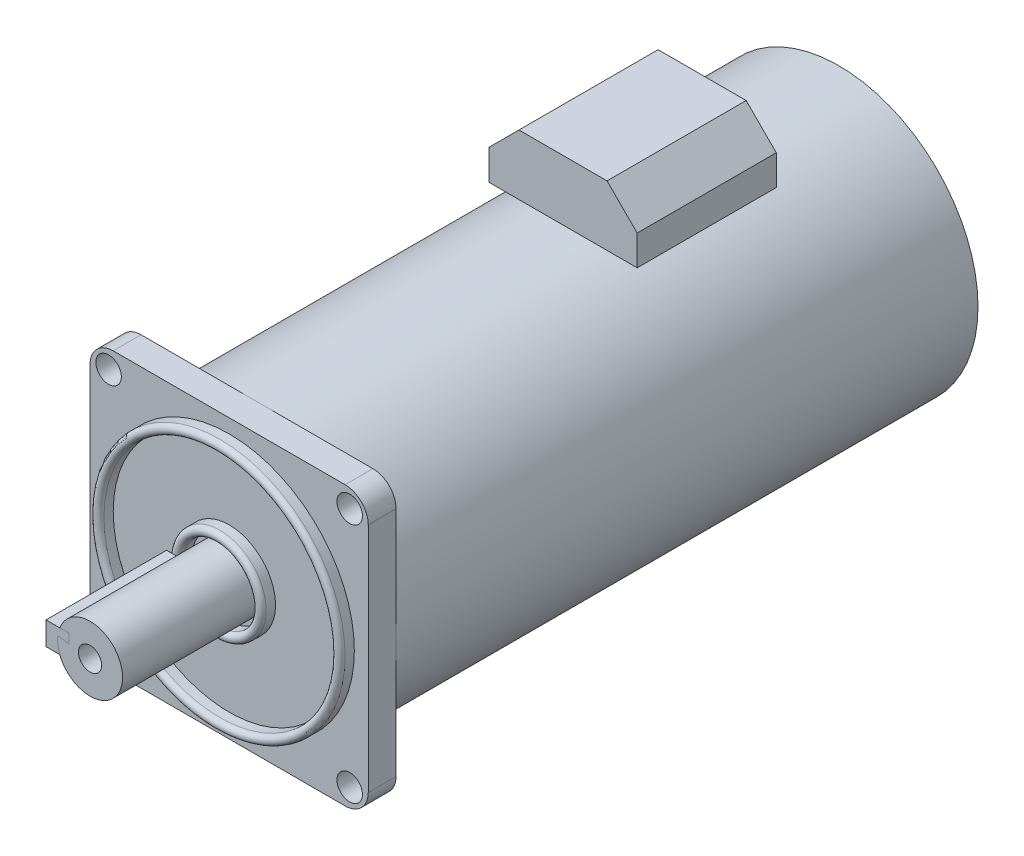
ISO-10303-21;
HEADER;
FILE_DESCRIPTION(('STEP AP214'),'2;1');
FILE_NAME('part.step','',(''),(''),'','','');
FILE_SCHEMA(('AUTOMOTIVE_DESIGN { 1 0 10303 214 1 1 1 1 }'));
ENDSEC;
DATA;
#1=APPLICATION_CONTEXT('core data for automotive mechanical design processes');
#2=APPLICATION_PROTOCOL_DEFINITION('international standard','automotive_design',2000,#1);
#3=PRODUCT_CONTEXT('',#1,'mechanical');
#4=PRODUCT('Part','Part','',(#3));
#5=PRODUCT_RELATED_PRODUCT_CATEGORY('part','',(#4));
#6=PRODUCT_DEFINITION_FORMATION('','',#4);
#7=PRODUCT_DEFINITION_CONTEXT('part definition',#1,'design');
#8=PRODUCT_DEFINITION('design','',#6,#7);
#9=PRODUCT_DEFINITION_SHAPE('','',#8);
#10=(LENGTH_UNIT() NAMED_UNIT(*) SI_UNIT(.MILLI.,.METRE.));
#11=(NAMED_UNIT(*) PLANE_ANGLE_UNIT() SI_UNIT($,.RADIAN.));
#12=(NAMED_UNIT(*) SI_UNIT($,.STERADIAN.) SOLID_ANGLE_UNIT());
#13=UNCERTAINTY_MEASURE_WITH_UNIT(LENGTH_MEASURE(1.E-05),#10,'distance_accuracy_value','');
#14=(GEOMETRIC_REPRESENTATION_CONTEXT(3) GLOBAL_UNCERTAINTY_ASSIGNED_CONTEXT((#13)) GLOBAL_UNIT_ASSIGNED_CONTEXT((#10,
#11,#12)) REPRESENTATION_CONTEXT('',''));
#15=CARTESIAN_POINT('',(0.,0.,0.));
#16=DIRECTION('',(0.,0.,1.));
#17=DIRECTION('',(1.,0.,0.));
#18=AXIS2_PLACEMENT_3D('',#15,#16,#17);
#19=CARTESIAN_POINT('',(16.,43.,29.5));
#20=DIRECTION('',(-1.,0.,0.));
#21=DIRECTION('',(0.,0.,1.));
#22=AXIS2_PLACEMENT_3D('',#19,#20,#21);
#23=PLANE('',#22);
#24=DIRECTION('',(0.,-1.,0.));
#25=VECTOR('',#24,1.);
#26=CARTESIAN_POINT('',(16.,43.,29.5));
#27=LINE('',#26,#25);
#28=CARTESIAN_POINT('',(16.,36.5,29.5));
#29=VERTEX_POINT('',#28);
#30=CARTESIAN_POINT('',(16.,30.,29.5));
#31=VERTEX_POINT('',#30);
#32=EDGE_CURVE('E108',#29,#31,#27,.T.);
#33=ORIENTED_EDGE('',*,*,#32,.F.);
#34=DIRECTION('',(0.,0.,1.));
#35=VECTOR('',#34,1.);
#36=CARTESIAN_POINT('',(16.,36.5,59.5));
#37=LINE('',#36,#35);
#38=CARTESIAN_POINT('',(16.,36.5,59.5));
#39=VERTEX_POINT('',#38);
#40=EDGE_CURVE('E13',#29,#39,#37,.T.);
#41=ORIENTED_EDGE('',*,*,#40,.T.);
#42=DIRECTION('',(0.,-1.,0.));
#43=VECTOR('',#42,1.);
#44=CARTESIAN_POINT('',(16.,43.,59.5));
#45=LINE('',#44,#43);
#46=CARTESIAN_POINT('',(16.,30.,59.5));
#47=VERTEX_POINT('',#46);
#48=EDGE_CURVE('E128',#39,#47,#45,.T.);
#49=ORIENTED_EDGE('',*,*,#48,.T.);
#50=DIRECTION('',(0.,0.,-1.));
#51=VECTOR('',#50,1.);
#52=CARTESIAN_POINT('',(16.,30.,29.5));
#53=LINE('',#52,#51);
#54=EDGE_CURVE('E123',#47,#31,#53,.T.);
#55=ORIENTED_EDGE('',*,*,#54,.T.);
#56=EDGE_LOOP('',(#33,#41,#49,#55));
#57=FACE_BOUND('',#56,.T.);
#58=ADVANCED_FACE('F57',(#57),#23,.F.);
#59=CARTESIAN_POINT('',(-16.,43.,29.5));
#60=DIRECTION('',(0.,0.,1.));
#61=DIRECTION('',(1.,0.,0.));
#62=AXIS2_PLACEMENT_3D('',#59,#60,#61);
#63=PLANE('',#62);
#64=DIRECTION('',(0.,-1.,0.));
#65=VECTOR('',#64,1.);
#66=CARTESIAN_POINT('',(-16.,43.,29.5));
#67=LINE('',#66,#65);
#68=CARTESIAN_POINT('',(-16.,36.5,29.5));
#69=VERTEX_POINT('',#68);
#70=CARTESIAN_POINT('',(-16.,30.,29.5));
#71=VERTEX_POINT('',#70);
#72=EDGE_CURVE('E117',#69,#71,#67,.T.);
#73=ORIENTED_EDGE('',*,*,#72,.F.);
#74=DIRECTION('',(0.707106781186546,0.707106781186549,0.));
#75=VECTOR('',#74,1.);
#76=CARTESIAN_POINT('',(-9.50000000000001,43.,29.5));
#77=LINE('',#76,#75);
#78=CARTESIAN_POINT('',(-9.50000000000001,43.,29.5));
#79=VERTEX_POINT('',#78);
#80=EDGE_CURVE('E65',#69,#79,#77,.T.);
#81=ORIENTED_EDGE('',*,*,#80,.T.);
#82=DIRECTION('',(-1.,0.,0.));
#83=VECTOR('',#82,1.);
#84=CARTESIAN_POINT('',(-16.,43.,29.5));
#85=LINE('',#84,#83);
#86=CARTESIAN_POINT('',(9.49999999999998,43.,29.5));
#87=VERTEX_POINT('',#86);
#88=EDGE_CURVE('E138',#87,#79,#85,.T.);
#89=ORIENTED_EDGE('',*,*,#88,.F.);
#90=DIRECTION('',(0.707106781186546,-0.707106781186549,0.));
#91=VECTOR('',#90,1.);
#92=CARTESIAN_POINT('',(9.49999999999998,43.,29.5));
#93=LINE('',#92,#91);
#94=EDGE_CURVE('E72',#87,#29,#93,.T.);
#95=ORIENTED_EDGE('',*,*,#94,.T.);
#96=ORIENTED_EDGE('',*,*,#32,.T.);
#97=DIRECTION('',(-1.,0.,0.));
#98=VECTOR('',#97,1.);
#99=CARTESIAN_POINT('',(-16.,30.,29.5));
#100=LINE('',#99,#98);
#101=EDGE_CURVE('E111',#31,#71,#100,.T.);
#102=ORIENTED_EDGE('',*,*,#101,.T.);
#103=EDGE_LOOP('',(#73,#81,#89,#95,#96,#102));
#104=FACE_BOUND('',#103,.T.);
#105=ADVANCED_FACE('F110',(#104),#63,.F.);
#106=CARTESIAN_POINT('',(-16.,43.,29.5));
#107=DIRECTION('',(1.,0.,0.));
#108=DIRECTION('',(0.,0.,-1.));
#109=AXIS2_PLACEMENT_3D('',#106,#107,#108);
#110=PLANE('',#109);
#111=DIRECTION('',(0.,-1.,0.));
#112=VECTOR('',#111,1.);
#113=CARTESIAN_POINT('',(-16.,43.,59.5));
#114=LINE('',#113,#112);
#115=CARTESIAN_POINT('',(-16.,36.5,59.5));
#116=VERTEX_POINT('',#115);
#117=CARTESIAN_POINT('',(-16.,30.,59.5));
#118=VERTEX_POINT('',#117);
#119=EDGE_CURVE('E140',#116,#118,#114,.T.);
#120=ORIENTED_EDGE('',*,*,#119,.F.);
#121=DIRECTION('',(0.,0.,-1.));
#122=VECTOR('',#121,1.);
#123=CARTESIAN_POINT('',(-16.,36.5,29.5));
#124=LINE('',#123,#122);
#125=EDGE_CURVE('E80',#116,#69,#124,.T.);
#126=ORIENTED_EDGE('',*,*,#125,.T.);
#127=ORIENTED_EDGE('',*,*,#72,.T.);
#128=DIRECTION('',(0.,0.,1.));
#129=VECTOR('',#128,1.);
#130=CARTESIAN_POINT('',(-16.,30.,29.5));
#131=LINE('',#130,#129);
#132=EDGE_CURVE('E125',#71,#118,#131,.T.);
#133=ORIENTED_EDGE('',*,*,#132,.T.);
#134=EDGE_LOOP('',(#120,#126,#127,#133));
#135=FACE_BOUND('',#134,.T.);
#136=ADVANCED_FACE('F165',(#135),#110,.F.);
#137=CARTESIAN_POINT('',(-16.,43.,59.5));
#138=DIRECTION('',(0.,0.,-1.));
#139=DIRECTION('',(-1.,0.,0.));
#140=AXIS2_PLACEMENT_3D('',#137,#138,#139);
#141=PLANE('',#140);
#142=DIRECTION('',(1.,0.,0.));
#143=VECTOR('',#142,1.);
#144=CARTESIAN_POINT('',(-16.,43.,59.5));
#145=LINE('',#144,#143);
#146=CARTESIAN_POINT('',(-9.50000000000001,43.,59.5));
#147=VERTEX_POINT('',#146);
#148=CARTESIAN_POINT('',(9.50000000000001,43.,59.5));
#149=VERTEX_POINT('',#148);
#150=EDGE_CURVE('E132',#147,#149,#145,.T.);
#151=ORIENTED_EDGE('',*,*,#150,.F.);
#152=DIRECTION('',(-0.707106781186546,-0.707106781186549,0.));
#153=VECTOR('',#152,1.);
#154=CARTESIAN_POINT('',(-9.50000000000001,43.,59.5));
#155=LINE('',#154,#153);
#156=EDGE_CURVE('E150',#147,#116,#155,.T.);
#157=ORIENTED_EDGE('',*,*,#156,.T.);
#158=ORIENTED_EDGE('',*,*,#119,.T.);
#159=DIRECTION('',(1.,0.,0.));
#160=VECTOR('',#159,1.);
#161=CARTESIAN_POINT('',(-16.,30.,59.5));
#162=LINE('',#161,#160);
#163=EDGE_CURVE('E136',#118,#47,#162,.T.);
#164=ORIENTED_EDGE('',*,*,#163,.T.);
#165=ORIENTED_EDGE('',*,*,#48,.F.);
#166=DIRECTION('',(-0.707106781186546,0.707106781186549,0.));
#167=VECTOR('',#166,1.);
#168=CARTESIAN_POINT('',(9.49999999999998,43.,59.5));
#169=LINE('',#168,#167);
#170=EDGE_CURVE('E148',#39,#149,#169,.T.);
#171=ORIENTED_EDGE('',*,*,#170,.T.);
#172=EDGE_LOOP('',(#151,#157,#158,#164,#165,#171));
#173=FACE_BOUND('',#172,.T.);
#174=ADVANCED_FACE('F164',(#173),#141,.F.);
#175=CARTESIAN_POINT('',(0.,43.,0.));
#176=DIRECTION('',(0.,1.,0.));
#177=DIRECTION('',(0.,0.,1.));
#178=AXIS2_PLACEMENT_3D('',#175,#176,#177);
#179=PLANE('',#178);
#180=ORIENTED_EDGE('',*,*,#88,.T.);
#181=DIRECTION('',(0.,0.,1.));
#182=VECTOR('',#181,1.);
#183=CARTESIAN_POINT('',(-9.50000000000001,43.,59.5));
#184=LINE('',#183,#182);
#185=EDGE_CURVE('E145',#79,#147,#184,.T.);
#186=ORIENTED_EDGE('',*,*,#185,.T.);
#187=ORIENTED_EDGE('',*,*,#150,.T.);
#188=DIRECTION('',(0.,0.,-1.));
#189=VECTOR('',#188,1.);
#190=CARTESIAN_POINT('',(9.49999999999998,43.,29.5));
#191=LINE('',#190,#189);
#192=EDGE_CURVE('E116',#149,#87,#191,.T.);
#193=ORIENTED_EDGE('',*,*,#192,.T.);
#194=EDGE_LOOP('',(#180,#186,#187,#193));
#195=FACE_BOUND('',#194,.T.);
#196=ADVANCED_FACE('F158',(#195),#179,.T.);
#197=CARTESIAN_POINT('',(0.,30.,0.));
#198=DIRECTION('',(0.,1.,0.));
#199=DIRECTION('',(0.,0.,1.));
#200=AXIS2_PLACEMENT_3D('',#197,#198,#199);
#201=PLANE('',#200);
#202=ORIENTED_EDGE('',*,*,#54,.F.);
#203=ORIENTED_EDGE('',*,*,#163,.F.);
#204=ORIENTED_EDGE('',*,*,#132,.F.);
#205=ORIENTED_EDGE('',*,*,#101,.F.);
#206=EDGE_LOOP('',(#202,#203,#204,#205));
#207=FACE_BOUND('',#206,.T.);
#208=ADVANCED_FACE('F121',(#207),#201,.F.);
#209=CARTESIAN_POINT('',(-9.50000000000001,43.,0.));
#210=DIRECTION('',(-0.707106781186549,0.707106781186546,0.));
#211=DIRECTION('',(0.,0.,-1.));
#212=AXIS2_PLACEMENT_3D('',#209,#210,#211);
#213=PLANE('',#212);
#214=ORIENTED_EDGE('',*,*,#80,.F.);
#215=ORIENTED_EDGE('',*,*,#125,.F.);
#216=ORIENTED_EDGE('',*,*,#156,.F.);
#217=ORIENTED_EDGE('',*,*,#185,.F.);
#218=EDGE_LOOP('',(#214,#215,#216,#217));
#219=FACE_BOUND('',#218,.T.);
#220=ADVANCED_FACE('F162',(#219),#213,.T.);
#221=CARTESIAN_POINT('',(9.49999999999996,43.,0.));
#222=DIRECTION('',(0.707106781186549,0.707106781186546,0.));
#223=DIRECTION('',(0.,0.,1.));
#224=AXIS2_PLACEMENT_3D('',#221,#222,#223);
#225=PLANE('',#224);
#226=ORIENTED_EDGE('',*,*,#170,.F.);
#227=ORIENTED_EDGE('',*,*,#40,.F.);
#228=ORIENTED_EDGE('',*,*,#94,.F.);
#229=ORIENTED_EDGE('',*,*,#192,.F.);
#230=EDGE_LOOP('',(#226,#227,#228,#229));
#231=FACE_BOUND('',#230,.T.);
#232=ADVANCED_FACE('F59',(#231),#225,.T.);
#233=CLOSED_SHELL('',(#58,#105,#136,#174,#196,#208,#220,#232));
#234=MANIFOLD_SOLID_BREP('B2',#233);
#235=CARTESIAN_POINT('',(-9.5,-2.5,135.5));
#236=DIRECTION('',(-1.,0.,0.));
#237=DIRECTION('',(0.,0.,1.));
#238=AXIS2_PLACEMENT_3D('',#235,#236,#237);
#239=PLANE('',#238);
#240=DIRECTION('',(0.,-1.,0.));
#241=VECTOR('',#240,1.);
#242=CARTESIAN_POINT('',(-9.5,-2.5,161.5));
#243=LINE('',#242,#241);
#244=CARTESIAN_POINT('',(-9.5,2.5,161.5));
#245=VERTEX_POINT('',#244);
#246=CARTESIAN_POINT('',(-9.5,-2.5,161.5));
#247=VERTEX_POINT('',#246);
#248=EDGE_CURVE('E305',#245,#247,#243,.T.);
#249=ORIENTED_EDGE('',*,*,#248,.F.);
#250=DIRECTION('',(0.,0.,1.));
#251=VECTOR('',#250,1.);
#252=CARTESIAN_POINT('',(-9.5,2.5,135.5));
#253=LINE('',#252,#251);
#254=CARTESIAN_POINT('',(-9.5,2.5,135.5));
#255=VERTEX_POINT('',#254);
#256=EDGE_CURVE('E55',#255,#245,#253,.T.);
#257=ORIENTED_EDGE('',*,*,#256,.F.);
#258=DIRECTION('',(0.,-1.,0.));
#259=VECTOR('',#258,1.);
#260=CARTESIAN_POINT('',(-9.5,-2.5,135.5));
#261=LINE('',#260,#259);
#262=CARTESIAN_POINT('',(-9.5,-2.5,135.5));
#263=VERTEX_POINT('',#262);
#264=EDGE_CURVE('E299',#255,#263,#261,.T.);
#265=ORIENTED_EDGE('',*,*,#264,.T.);
#266=DIRECTION('',(0.,0.,1.));
#267=VECTOR('',#266,1.);
#268=CARTESIAN_POINT('',(-9.5,-2.5,135.5));
#269=LINE('',#268,#267);
#270=EDGE_CURVE('E244',#263,#247,#269,.T.);
#271=ORIENTED_EDGE('',*,*,#270,.T.);
#272=EDGE_LOOP('',(#249,#257,#265,#271));
#273=FACE_BOUND('',#272,.T.);
#274=ADVANCED_FACE('F241',(#273),#239,.T.);
#275=CARTESIAN_POINT('',(-4.5,2.5,135.5));
#276=DIRECTION('',(0.,1.,0.));
#277=DIRECTION('',(0.,0.,1.));
#278=AXIS2_PLACEMENT_3D('',#275,#276,#277);
#279=PLANE('',#278);
#280=DIRECTION('',(-1.,0.,0.));
#281=VECTOR('',#280,1.);
#282=CARTESIAN_POINT('',(-4.5,2.5,161.5));
#283=LINE('',#282,#281);
#284=CARTESIAN_POINT('',(-4.5,2.5,161.5));
#285=VERTEX_POINT('',#284);
#286=EDGE_CURVE('E301',#285,#245,#283,.T.);
#287=ORIENTED_EDGE('',*,*,#286,.F.);
#288=DIRECTION('',(0.,0.,1.));
#289=VECTOR('',#288,1.);
#290=CARTESIAN_POINT('',(-4.5,2.5,135.5));
#291=LINE('',#290,#289);
#292=CARTESIAN_POINT('',(-4.5,2.5,135.5));
#293=VERTEX_POINT('',#292);
#294=EDGE_CURVE('E250',#293,#285,#291,.T.);
#295=ORIENTED_EDGE('',*,*,#294,.F.);
#296=DIRECTION('',(-1.,0.,0.));
#297=VECTOR('',#296,1.);
#298=CARTESIAN_POINT('',(-4.5,2.5,135.5));
#299=LINE('',#298,#297);
#300=EDGE_CURVE('E296',#293,#255,#299,.T.);
#301=ORIENTED_EDGE('',*,*,#300,.T.);
#302=ORIENTED_EDGE('',*,*,#256,.T.);
#303=EDGE_LOOP('',(#287,#295,#301,#302));
#304=FACE_BOUND('',#303,.T.);
#305=ADVANCED_FACE('F315',(#304),#279,.T.);
#306=CARTESIAN_POINT('',(-4.5,-2.5,135.5));
#307=DIRECTION('',(1.,0.,0.));
#308=DIRECTION('',(0.,0.,-1.));
#309=AXIS2_PLACEMENT_3D('',#306,#307,#308);
#310=PLANE('',#309);
#311=DIRECTION('',(0.,1.,0.));
#312=VECTOR('',#311,1.);
#313=CARTESIAN_POINT('',(-4.5,-2.5,161.5));
#314=LINE('',#313,#312);
#315=CARTESIAN_POINT('',(-4.5,-2.5,161.5));
#316=VERTEX_POINT('',#315);
#317=EDGE_CURVE('E291',#316,#285,#314,.T.);
#318=ORIENTED_EDGE('',*,*,#317,.F.);
#319=DIRECTION('',(0.,0.,1.));
#320=VECTOR('',#319,1.);
#321=CARTESIAN_POINT('',(-4.5,-2.5,135.5));
#322=LINE('',#321,#320);
#323=CARTESIAN_POINT('',(-4.5,-2.5,135.5));
#324=VERTEX_POINT('',#323);
#325=EDGE_CURVE('E286',#324,#316,#322,.T.);
#326=ORIENTED_EDGE('',*,*,#325,.F.);
#327=DIRECTION('',(0.,1.,0.));
#328=VECTOR('',#327,1.);
#329=CARTESIAN_POINT('',(-4.5,-2.5,135.5));
#330=LINE('',#329,#328);
#331=EDGE_CURVE('E289',#324,#293,#330,.T.);
#332=ORIENTED_EDGE('',*,*,#331,.T.);
#333=ORIENTED_EDGE('',*,*,#294,.T.);
#334=EDGE_LOOP('',(#318,#326,#332,#333));
#335=FACE_BOUND('',#334,.T.);
#336=ADVANCED_FACE('F288',(#335),#310,.T.);
#337=CARTESIAN_POINT('',(-4.5,-2.5,135.5));
#338=DIRECTION('',(0.,-1.,0.));
#339=DIRECTION('',(1.,0.,0.));
#340=AXIS2_PLACEMENT_3D('',#337,#338,#339);
#341=PLANE('',#340);
#342=DIRECTION('',(1.,0.,0.));
#343=VECTOR('',#342,1.);
#344=CARTESIAN_POINT('',(-4.5,-2.5,161.5));
#345=LINE('',#344,#343);
#346=EDGE_CURVE('E308',#247,#316,#345,.T.);
#347=ORIENTED_EDGE('',*,*,#346,.F.);
#348=ORIENTED_EDGE('',*,*,#270,.F.);
#349=DIRECTION('',(1.,0.,0.));
#350=VECTOR('',#349,1.);
#351=CARTESIAN_POINT('',(-4.5,-2.5,135.5));
#352=LINE('',#351,#350);
#353=EDGE_CURVE('E295',#263,#324,#352,.T.);
#354=ORIENTED_EDGE('',*,*,#353,.T.);
#355=ORIENTED_EDGE('',*,*,#325,.T.);
#356=EDGE_LOOP('',(#347,#348,#354,#355));
#357=FACE_BOUND('',#356,.T.);
#358=ADVANCED_FACE('F298',(#357),#341,.T.);
#359=CARTESIAN_POINT('',(0.,0.,135.5));
#360=DIRECTION('',(0.,0.,1.));
#361=DIRECTION('',(1.,0.,0.));
#362=AXIS2_PLACEMENT_3D('',#359,#360,#361);
#363=PLANE('',#362);
#364=ORIENTED_EDGE('',*,*,#264,.F.);
#365=ORIENTED_EDGE('',*,*,#300,.F.);
#366=ORIENTED_EDGE('',*,*,#331,.F.);
#367=ORIENTED_EDGE('',*,*,#353,.F.);
#368=EDGE_LOOP('',(#364,#365,#366,#367));
#369=FACE_BOUND('',#368,.T.);
#370=ADVANCED_FACE('F294',(#369),#363,.F.);
#371=CARTESIAN_POINT('',(0.,0.,161.5));
#372=DIRECTION('',(0.,0.,1.));
#373=DIRECTION('',(1.,0.,0.));
#374=AXIS2_PLACEMENT_3D('',#371,#372,#373);
#375=PLANE('',#374);
#376=ORIENTED_EDGE('',*,*,#248,.T.);
#377=ORIENTED_EDGE('',*,*,#346,.T.);
#378=ORIENTED_EDGE('',*,*,#317,.T.);
#379=ORIENTED_EDGE('',*,*,#286,.T.);
#380=EDGE_LOOP('',(#376,#377,#378,#379));
#381=FACE_BOUND('',#380,.T.);
#382=ADVANCED_FACE('F314',(#381),#375,.T.);
#383=CLOSED_SHELL('',(#274,#305,#336,#358,#370,#382));
#384=MANIFOLD_SOLID_BREP('B7',#383);
#385=CARTESIAN_POINT('',(0.,0.,133.5));
#386=DIRECTION('',(0.,0.,1.));
#387=DIRECTION('',(1.,0.,0.));
#388=AXIS2_PLACEMENT_3D('',#385,#386,#387);
#389=TOROIDAL_SURFACE('',#388,9.,1.);
#390=CARTESIAN_POINT('',(0.,0.,133.5));
#391=DIRECTION('',(0.,0.,1.));
#392=DIRECTION('',(1.,0.,0.));
#393=AXIS2_PLACEMENT_3D('',#390,#391,#392);
#394=CIRCLE('',#393,8.);
#395=CARTESIAN_POINT('',(8.,0.,133.5));
#396=VERTEX_POINT('',#395);
#397=EDGE_CURVE('E548',#396,#396,#394,.T.);
#398=ORIENTED_EDGE('',*,*,#397,.F.);
#399=EDGE_LOOP('',(#398));
#400=FACE_BOUND('',#399,.T.);
#401=CARTESIAN_POINT('',(0.,0.,133.5));
#402=DIRECTION('',(0.,0.,1.));
#403=DIRECTION('',(1.,0.,0.));
#404=AXIS2_PLACEMENT_3D('',#401,#402,#403);
#405=CIRCLE('',#404,10.);
#406=CARTESIAN_POINT('',(10.,0.,133.5));
#407=VERTEX_POINT('',#406);
#408=EDGE_CURVE('E373',#407,#407,#405,.F.);
#409=ORIENTED_EDGE('',*,*,#408,.F.);
#410=EDGE_LOOP('',(#409));
#411=FACE_BOUND('',#410,.T.);
#412=ADVANCED_FACE('F364',(#400,#411),#389,.T.);
#413=CARTESIAN_POINT('',(0.,0.,133.5));
#414=DIRECTION('',(0.,0.,1.));
#415=DIRECTION('',(1.,0.,0.));
#416=AXIS2_PLACEMENT_3D('',#413,#414,#415);
#417=TOROIDAL_SURFACE('',#416,26.,1.);
#418=CARTESIAN_POINT('',(0.,0.,133.5));
#419=DIRECTION('',(0.,0.,1.));
#420=DIRECTION('',(1.,0.,0.));
#421=AXIS2_PLACEMENT_3D('',#418,#419,#420);
#422=CIRCLE('',#421,25.);
#423=CARTESIAN_POINT('',(25.,0.,133.5));
#424=VERTEX_POINT('',#423);
#425=EDGE_CURVE('E539',#424,#424,#422,.T.);
#426=ORIENTED_EDGE('',*,*,#425,.F.);
#427=EDGE_LOOP('',(#426));
#428=FACE_BOUND('',#427,.T.);
#429=CARTESIAN_POINT('',(0.,0.,133.5));
#430=DIRECTION('',(0.,0.,1.));
#431=DIRECTION('',(1.,0.,0.));
#432=AXIS2_PLACEMENT_3D('',#429,#430,#431);
#433=CIRCLE('',#432,27.);
#434=CARTESIAN_POINT('',(27.,0.,133.5));
#435=VERTEX_POINT('',#434);
#436=EDGE_CURVE('E542',#435,#435,#433,.F.);
#437=ORIENTED_EDGE('',*,*,#436,.F.);
#438=EDGE_LOOP('',(#437));
#439=FACE_BOUND('',#438,.T.);
#440=ADVANCED_FACE('F558',(#428,#439),#417,.T.);
#441=CARTESIAN_POINT('',(0.,0.,100.));
#442=DIRECTION('',(0.,0.,-1.));
#443=DIRECTION('',(-1.,0.,0.));
#444=AXIS2_PLACEMENT_3D('',#441,#442,#443);
#445=CYLINDRICAL_SURFACE('',#444,30.);
#446=CARTESIAN_POINT('',(0.,0.,0.));
#447=DIRECTION('',(0.,0.,1.));
#448=DIRECTION('',(1.,0.,0.));
#449=AXIS2_PLACEMENT_3D('',#446,#447,#448);
#450=CIRCLE('',#449,30.);
#451=CARTESIAN_POINT('',(30.,0.,0.));
#452=VERTEX_POINT('',#451);
#453=EDGE_CURVE('E497',#452,#452,#450,.T.);
#454=ORIENTED_EDGE('',*,*,#453,.T.);
#455=EDGE_LOOP('',(#454));
#456=FACE_BOUND('',#455,.T.);
#457=CARTESIAN_POINT('',(0.,0.,125.5));
#458=DIRECTION('',(0.,0.,1.));
#459=DIRECTION('',(1.,0.,0.));
#460=AXIS2_PLACEMENT_3D('',#457,#458,#459);
#461=CIRCLE('',#460,30.);
#462=CARTESIAN_POINT('',(30.,0.,125.5));
#463=VERTEX_POINT('',#462);
#464=CARTESIAN_POINT('',(0.,30.,125.5));
#465=VERTEX_POINT('',#464);
#466=EDGE_CURVE('E494',#463,#465,#461,.T.);
#467=ORIENTED_EDGE('',*,*,#466,.F.);
#468=CARTESIAN_POINT('',(0.,-30.,125.5));
#469=VERTEX_POINT('',#468);
#470=EDGE_CURVE('E483',#469,#463,#461,.T.);
#471=ORIENTED_EDGE('',*,*,#470,.F.);
#472=CARTESIAN_POINT('',(-30.,0.,125.5));
#473=VERTEX_POINT('',#472);
#474=EDGE_CURVE('E642',#473,#469,#461,.T.);
#475=ORIENTED_EDGE('',*,*,#474,.F.);
#476=EDGE_CURVE('E498',#465,#473,#461,.T.);
#477=ORIENTED_EDGE('',*,*,#476,.F.);
#478=EDGE_LOOP('',(#467,#471,#475,#477));
#479=FACE_BOUND('',#478,.T.);
#480=ADVANCED_FACE('F563',(#456,#479),#445,.T.);
#481=CARTESIAN_POINT('',(0.,0.,0.));
#482=DIRECTION('',(0.,0.,1.));
#483=DIRECTION('',(1.,0.,0.));
#484=AXIS2_PLACEMENT_3D('',#481,#482,#483);
#485=PLANE('',#484);
#486=ORIENTED_EDGE('',*,*,#453,.F.);
#487=EDGE_LOOP('',(#486));
#488=FACE_BOUND('',#487,.T.);
#489=ADVANCED_FACE('F672',(#488),#485,.F.);
#490=CARTESIAN_POINT('',(0.,0.,125.5));
#491=DIRECTION('',(0.,0.,-1.));
#492=DIRECTION('',(-1.,0.,0.));
#493=AXIS2_PLACEMENT_3D('',#490,#491,#492);
#494=PLANE('',#493);
#495=CARTESIAN_POINT('',(26.,26.,125.5));
#496=DIRECTION('',(0.,0.,-1.));
#497=DIRECTION('',(-1.,0.,0.));
#498=AXIS2_PLACEMENT_3D('',#495,#496,#497);
#499=CIRCLE('',#498,2.75);
#500=CARTESIAN_POINT('',(28.75,26.,125.5));
#501=VERTEX_POINT('',#500);
#502=EDGE_CURVE('E742',#501,#501,#499,.T.);
#503=ORIENTED_EDGE('',*,*,#502,.F.);
#504=EDGE_LOOP('',(#503));
#505=FACE_BOUND('',#504,.T.);
#506=DIRECTION('',(-1.,0.,0.));
#507=VECTOR('',#506,1.);
#508=CARTESIAN_POINT('',(-30.,30.,125.5));
#509=LINE('',#508,#507);
#510=CARTESIAN_POINT('',(25.,30.,125.5));
#511=VERTEX_POINT('',#510);
#512=EDGE_CURVE('E487',#511,#465,#509,.T.);
#513=ORIENTED_EDGE('',*,*,#512,.F.);
#514=CARTESIAN_POINT('',(25.,25.,125.5));
#515=DIRECTION('',(0.,0.,-1.));
#516=DIRECTION('',(-1.,0.,0.));
#517=AXIS2_PLACEMENT_3D('',#514,#515,#516);
#518=CIRCLE('',#517,5.);
#519=CARTESIAN_POINT('',(30.,25.,125.5));
#520=VERTEX_POINT('',#519);
#521=EDGE_CURVE('E380',#511,#520,#518,.T.);
#522=ORIENTED_EDGE('',*,*,#521,.T.);
#523=DIRECTION('',(0.,1.,0.));
#524=VECTOR('',#523,1.);
#525=CARTESIAN_POINT('',(30.,-30.,125.5));
#526=LINE('',#525,#524);
#527=EDGE_CURVE('E470',#463,#520,#526,.T.);
#528=ORIENTED_EDGE('',*,*,#527,.F.);
#529=ORIENTED_EDGE('',*,*,#466,.T.);
#530=EDGE_LOOP('',(#513,#522,#528,#529));
#531=FACE_BOUND('',#530,.T.);
#532=ADVANCED_FACE('F601',(#505,#531),#494,.T.);
#533=CARTESIAN_POINT('',(-26.,26.,125.5));
#534=DIRECTION('',(0.,0.,-1.));
#535=DIRECTION('',(-1.,0.,0.));
#536=AXIS2_PLACEMENT_3D('',#533,#534,#535);
#537=CIRCLE('',#536,2.75);
#538=CARTESIAN_POINT('',(-23.25,26.,125.5));
#539=VERTEX_POINT('',#538);
#540=EDGE_CURVE('E461',#539,#539,#537,.T.);
#541=ORIENTED_EDGE('',*,*,#540,.F.);
#542=EDGE_LOOP('',(#541));
#543=FACE_BOUND('',#542,.T.);
#544=DIRECTION('',(0.,-1.,0.));
#545=VECTOR('',#544,1.);
#546=CARTESIAN_POINT('',(-30.,-30.,125.5));
#547=LINE('',#546,#545);
#548=CARTESIAN_POINT('',(-30.,25.,125.5));
#549=VERTEX_POINT('',#548);
#550=EDGE_CURVE('E490',#549,#473,#547,.T.);
#551=ORIENTED_EDGE('',*,*,#550,.F.);
#552=CARTESIAN_POINT('',(-25.,25.,125.5));
#553=DIRECTION('',(0.,0.,-1.));
#554=DIRECTION('',(-1.,0.,0.));
#555=AXIS2_PLACEMENT_3D('',#552,#553,#554);
#556=CIRCLE('',#555,5.);
#557=CARTESIAN_POINT('',(-25.,30.,125.5));
#558=VERTEX_POINT('',#557);
#559=EDGE_CURVE('E504',#549,#558,#556,.T.);
#560=ORIENTED_EDGE('',*,*,#559,.T.);
#561=EDGE_CURVE('E486',#465,#558,#509,.T.);
#562=ORIENTED_EDGE('',*,*,#561,.F.);
#563=ORIENTED_EDGE('',*,*,#476,.T.);
#564=EDGE_LOOP('',(#551,#560,#562,#563));
#565=FACE_BOUND('',#564,.T.);
#566=ADVANCED_FACE('F669',(#543,#565),#494,.T.);
#567=CARTESIAN_POINT('',(-26.,-26.,125.5));
#568=DIRECTION('',(0.,0.,-1.));
#569=DIRECTION('',(-1.,0.,0.));
#570=AXIS2_PLACEMENT_3D('',#567,#568,#569);
#571=CIRCLE('',#570,2.75);
#572=CARTESIAN_POINT('',(-23.25,-26.,125.5));
#573=VERTEX_POINT('',#572);
#574=EDGE_CURVE('E745',#573,#573,#571,.T.);
#575=ORIENTED_EDGE('',*,*,#574,.F.);
#576=EDGE_LOOP('',(#575));
#577=FACE_BOUND('',#576,.T.);
#578=DIRECTION('',(1.,0.,0.));
#579=VECTOR('',#578,1.);
#580=CARTESIAN_POINT('',(-30.,-30.,125.5));
#581=LINE('',#580,#579);
#582=CARTESIAN_POINT('',(-25.,-30.,125.5));
#583=VERTEX_POINT('',#582);
#584=EDGE_CURVE('E475',#583,#469,#581,.T.);
#585=ORIENTED_EDGE('',*,*,#584,.F.);
#586=CARTESIAN_POINT('',(-25.,-25.,125.5));
#587=DIRECTION('',(0.,0.,-1.));
#588=DIRECTION('',(-1.,0.,0.));
#589=AXIS2_PLACEMENT_3D('',#586,#587,#588);
#590=CIRCLE('',#589,5.);
#591=CARTESIAN_POINT('',(-30.,-25.,125.5));
#592=VERTEX_POINT('',#591);
#593=EDGE_CURVE('E516',#583,#592,#590,.T.);
#594=ORIENTED_EDGE('',*,*,#593,.T.);
#595=EDGE_CURVE('E489',#473,#592,#547,.T.);
#596=ORIENTED_EDGE('',*,*,#595,.F.);
#597=ORIENTED_EDGE('',*,*,#474,.T.);
#598=EDGE_LOOP('',(#585,#594,#596,#597));
#599=FACE_BOUND('',#598,.T.);
#600=ADVANCED_FACE('F602',(#577,#599),#494,.T.);
#601=CARTESIAN_POINT('',(30.,-30.,131.5));
#602=DIRECTION('',(-1.,0.,0.));
#603=DIRECTION('',(0.,0.,1.));
#604=AXIS2_PLACEMENT_3D('',#601,#602,#603);
#605=PLANE('',#604);
#606=DIRECTION('',(0.,1.,0.));
#607=VECTOR('',#606,1.);
#608=CARTESIAN_POINT('',(30.,-30.,131.5));
#609=LINE('',#608,#607);
#610=CARTESIAN_POINT('',(30.,-25.,131.5));
#611=VERTEX_POINT('',#610);
#612=CARTESIAN_POINT('',(30.,25.,131.5));
#613=VERTEX_POINT('',#612);
#614=EDGE_CURVE('E471',#611,#613,#609,.T.);
#615=ORIENTED_EDGE('',*,*,#614,.F.);
#616=DIRECTION('',(0.,0.,-1.));
#617=VECTOR('',#616,1.);
#618=CARTESIAN_POINT('',(30.,-25.,131.5));
#619=LINE('',#618,#617);
#620=CARTESIAN_POINT('',(30.,-25.,125.5));
#621=VERTEX_POINT('',#620);
#622=EDGE_CURVE('E528',#611,#621,#619,.T.);
#623=ORIENTED_EDGE('',*,*,#622,.T.);
#624=EDGE_CURVE('E484',#621,#463,#526,.T.);
#625=ORIENTED_EDGE('',*,*,#624,.T.);
#626=ORIENTED_EDGE('',*,*,#527,.T.);
#627=DIRECTION('',(0.,0.,-1.));
#628=VECTOR('',#627,1.);
#629=CARTESIAN_POINT('',(30.,25.,131.5));
#630=LINE('',#629,#628);
#631=EDGE_CURVE('E526',#520,#613,#630,.F.);
#632=ORIENTED_EDGE('',*,*,#631,.T.);
#633=EDGE_LOOP('',(#615,#623,#625,#626,#632));
#634=FACE_BOUND('',#633,.T.);
#635=ADVANCED_FACE('F658',(#634),#605,.F.);
#636=CARTESIAN_POINT('',(-30.,30.,131.5));
#637=DIRECTION('',(0.,-1.,0.));
#638=DIRECTION('',(0.,0.,-1.));
#639=AXIS2_PLACEMENT_3D('',#636,#637,#638);
#640=PLANE('',#639);
#641=DIRECTION('',(-1.,0.,0.));
#642=VECTOR('',#641,1.);
#643=CARTESIAN_POINT('',(-30.,30.,131.5));
#644=LINE('',#643,#642);
#645=CARTESIAN_POINT('',(25.,30.,131.5));
#646=VERTEX_POINT('',#645);
#647=CARTESIAN_POINT('',(-25.,30.,131.5));
#648=VERTEX_POINT('',#647);
#649=EDGE_CURVE('E474',#646,#648,#644,.T.);
#650=ORIENTED_EDGE('',*,*,#649,.F.);
#651=DIRECTION('',(0.,0.,-1.));
#652=VECTOR('',#651,1.);
#653=CARTESIAN_POINT('',(25.,30.,131.5));
#654=LINE('',#653,#652);
#655=EDGE_CURVE('E533',#646,#511,#654,.T.);
#656=ORIENTED_EDGE('',*,*,#655,.T.);
#657=ORIENTED_EDGE('',*,*,#512,.T.);
#658=ORIENTED_EDGE('',*,*,#561,.T.);
#659=DIRECTION('',(0.,0.,-1.));
#660=VECTOR('',#659,1.);
#661=CARTESIAN_POINT('',(-25.,30.,131.5));
#662=LINE('',#661,#660);
#663=EDGE_CURVE('E506',#558,#648,#662,.F.);
#664=ORIENTED_EDGE('',*,*,#663,.T.);
#665=EDGE_LOOP('',(#650,#656,#657,#658,#664));
#666=FACE_BOUND('',#665,.T.);
#667=ADVANCED_FACE('F662',(#666),#640,.F.);
#668=CARTESIAN_POINT('',(-30.,-30.,131.5));
#669=DIRECTION('',(1.,0.,0.));
#670=DIRECTION('',(0.,0.,-1.));
#671=AXIS2_PLACEMENT_3D('',#668,#669,#670);
#672=PLANE('',#671);
#673=ORIENTED_EDGE('',*,*,#595,.T.);
#674=DIRECTION('',(0.,0.,-1.));
#675=VECTOR('',#674,1.);
#676=CARTESIAN_POINT('',(-30.,-25.,131.5));
#677=LINE('',#676,#675);
#678=CARTESIAN_POINT('',(-30.,-25.,131.5));
#679=VERTEX_POINT('',#678);
#680=EDGE_CURVE('E518',#592,#679,#677,.F.);
#681=ORIENTED_EDGE('',*,*,#680,.T.);
#682=DIRECTION('',(0.,-1.,0.));
#683=VECTOR('',#682,1.);
#684=CARTESIAN_POINT('',(-30.,-30.,131.5));
#685=LINE('',#684,#683);
#686=CARTESIAN_POINT('',(-30.,25.,131.5));
#687=VERTEX_POINT('',#686);
#688=EDGE_CURVE('E477',#687,#679,#685,.T.);
#689=ORIENTED_EDGE('',*,*,#688,.F.);
#690=DIRECTION('',(0.,0.,-1.));
#691=VECTOR('',#690,1.);
#692=CARTESIAN_POINT('',(-30.,25.,131.5));
#693=LINE('',#692,#691);
#694=EDGE_CURVE('E501',#687,#549,#693,.T.);
#695=ORIENTED_EDGE('',*,*,#694,.T.);
#696=ORIENTED_EDGE('',*,*,#550,.T.);
#697=EDGE_LOOP('',(#673,#681,#689,#695,#696));
#698=FACE_BOUND('',#697,.T.);
#699=ADVANCED_FACE('F603',(#698),#672,.F.);
#700=CARTESIAN_POINT('',(-30.,-30.,131.5));
#701=DIRECTION('',(0.,1.,0.));
#702=DIRECTION('',(0.,0.,1.));
#703=AXIS2_PLACEMENT_3D('',#700,#701,#702);
#704=PLANE('',#703);
#705=DIRECTION('',(1.,0.,0.));
#706=VECTOR('',#705,1.);
#707=CARTESIAN_POINT('',(-30.,-30.,131.5));
#708=LINE('',#707,#706);
#709=CARTESIAN_POINT('',(-25.,-30.,131.5));
#710=VERTEX_POINT('',#709);
#711=CARTESIAN_POINT('',(25.,-30.,131.5));
#712=VERTEX_POINT('',#711);
#713=EDGE_CURVE('E480',#710,#712,#708,.T.);
#714=ORIENTED_EDGE('',*,*,#713,.F.);
#715=DIRECTION('',(0.,0.,-1.));
#716=VECTOR('',#715,1.);
#717=CARTESIAN_POINT('',(-25.,-30.,131.5));
#718=LINE('',#717,#716);
#719=EDGE_CURVE('E513',#710,#583,#718,.T.);
#720=ORIENTED_EDGE('',*,*,#719,.T.);
#721=ORIENTED_EDGE('',*,*,#584,.T.);
#722=CARTESIAN_POINT('',(25.,-30.,125.5));
#723=VERTEX_POINT('',#722);
#724=EDGE_CURVE('E492',#469,#723,#581,.T.);
#725=ORIENTED_EDGE('',*,*,#724,.T.);
#726=DIRECTION('',(0.,0.,-1.));
#727=VECTOR('',#726,1.);
#728=CARTESIAN_POINT('',(25.,-30.,131.5));
#729=LINE('',#728,#727);
#730=EDGE_CURVE('E511',#723,#712,#729,.F.);
#731=ORIENTED_EDGE('',*,*,#730,.T.);
#732=EDGE_LOOP('',(#714,#720,#721,#725,#731));
#733=FACE_BOUND('',#732,.T.);
#734=ADVANCED_FACE('F593',(#733),#704,.F.);
#735=CARTESIAN_POINT('',(0.,0.,131.5));
#736=DIRECTION('',(0.,0.,-1.));
#737=DIRECTION('',(-1.,0.,0.));
#738=AXIS2_PLACEMENT_3D('',#735,#736,#737);
#739=PLANE('',#738);
#740=CARTESIAN_POINT('',(26.,26.,131.5));
#741=DIRECTION('',(0.,0.,1.));
#742=DIRECTION('',(1.,0.,0.));
#743=AXIS2_PLACEMENT_3D('',#740,#741,#742);
#744=CIRCLE('',#743,2.75);
#745=CARTESIAN_POINT('',(28.75,26.,131.5));
#746=VERTEX_POINT('',#745);
#747=EDGE_CURVE('E609',#746,#746,#744,.T.);
#748=ORIENTED_EDGE('',*,*,#747,.F.);
#749=EDGE_LOOP('',(#748));
#750=FACE_BOUND('',#749,.T.);
#751=CARTESIAN_POINT('',(26.,-26.,131.5));
#752=DIRECTION('',(0.,0.,1.));
#753=DIRECTION('',(1.,0.,0.));
#754=AXIS2_PLACEMENT_3D('',#751,#752,#753);
#755=CIRCLE('',#754,2.75);
#756=CARTESIAN_POINT('',(28.75,-26.,131.5));
#757=VERTEX_POINT('',#756);
#758=EDGE_CURVE('E613',#757,#757,#755,.T.);
#759=ORIENTED_EDGE('',*,*,#758,.F.);
#760=EDGE_LOOP('',(#759));
#761=FACE_BOUND('',#760,.T.);
#762=CARTESIAN_POINT('',(-26.,-26.,131.5));
#763=DIRECTION('',(0.,0.,1.));
#764=DIRECTION('',(1.,0.,0.));
#765=AXIS2_PLACEMENT_3D('',#762,#763,#764);
#766=CIRCLE('',#765,2.75);
#767=CARTESIAN_POINT('',(-23.25,-26.,131.5));
#768=VERTEX_POINT('',#767);
#769=EDGE_CURVE('E617',#768,#768,#766,.T.);
#770=ORIENTED_EDGE('',*,*,#769,.F.);
#771=EDGE_LOOP('',(#770));
#772=FACE_BOUND('',#771,.T.);
#773=CARTESIAN_POINT('',(-26.,26.,131.5));
#774=DIRECTION('',(0.,0.,1.));
#775=DIRECTION('',(1.,0.,0.));
#776=AXIS2_PLACEMENT_3D('',#773,#774,#775);
#777=CIRCLE('',#776,2.75);
#778=CARTESIAN_POINT('',(-23.25,26.,131.5));
#779=VERTEX_POINT('',#778);
#780=EDGE_CURVE('E621',#779,#779,#777,.T.);
#781=ORIENTED_EDGE('',*,*,#780,.F.);
#782=EDGE_LOOP('',(#781));
#783=FACE_BOUND('',#782,.T.);
#784=CARTESIAN_POINT('',(0.,0.,131.5));
#785=DIRECTION('',(0.,0.,-1.));
#786=DIRECTION('',(-1.,0.,0.));
#787=AXIS2_PLACEMENT_3D('',#784,#785,#786);
#788=CIRCLE('',#787,27.);
#789=CARTESIAN_POINT('',(-27.,0.,131.5));
#790=VERTEX_POINT('',#789);
#791=EDGE_CURVE('E536',#790,#790,#788,.F.);
#792=ORIENTED_EDGE('',*,*,#791,.F.);
#793=EDGE_LOOP('',(#792));
#794=FACE_BOUND('',#793,.T.);
#795=ORIENTED_EDGE('',*,*,#688,.T.);
#796=CARTESIAN_POINT('',(-25.,-25.,131.5));
#797=DIRECTION('',(0.,0.,-1.));
#798=DIRECTION('',(-1.,0.,0.));
#799=AXIS2_PLACEMENT_3D('',#796,#797,#798);
#800=CIRCLE('',#799,5.);
#801=EDGE_CURVE('E524',#679,#710,#800,.F.);
#802=ORIENTED_EDGE('',*,*,#801,.T.);
#803=ORIENTED_EDGE('',*,*,#713,.T.);
#804=CARTESIAN_POINT('',(25.,-25.,131.5));
#805=DIRECTION('',(0.,0.,-1.));
#806=DIRECTION('',(-1.,0.,0.));
#807=AXIS2_PLACEMENT_3D('',#804,#805,#806);
#808=CIRCLE('',#807,5.);
#809=EDGE_CURVE('E522',#712,#611,#808,.F.);
#810=ORIENTED_EDGE('',*,*,#809,.T.);
#811=ORIENTED_EDGE('',*,*,#614,.T.);
#812=CARTESIAN_POINT('',(25.,25.,131.5));
#813=DIRECTION('',(0.,0.,-1.));
#814=DIRECTION('',(-1.,0.,0.));
#815=AXIS2_PLACEMENT_3D('',#812,#813,#814);
#816=CIRCLE('',#815,5.);
#817=EDGE_CURVE('E520',#613,#646,#816,.F.);
#818=ORIENTED_EDGE('',*,*,#817,.T.);
#819=ORIENTED_EDGE('',*,*,#649,.T.);
#820=CARTESIAN_POINT('',(-25.,25.,131.5));
#821=DIRECTION('',(0.,0.,-1.));
#822=DIRECTION('',(-1.,0.,0.));
#823=AXIS2_PLACEMENT_3D('',#820,#821,#822);
#824=CIRCLE('',#823,5.);
#825=EDGE_CURVE('E509',#648,#687,#824,.F.);
#826=ORIENTED_EDGE('',*,*,#825,.T.);
#827=EDGE_LOOP('',(#795,#802,#803,#810,#811,#818,#819,#826));
#828=FACE_BOUND('',#827,.T.);
#829=ADVANCED_FACE('F579',(#750,#761,#772,#783,#794,#828),#739,.F.);
#830=CARTESIAN_POINT('',(26.,-26.,125.5));
#831=DIRECTION('',(0.,0.,-1.));
#832=DIRECTION('',(-1.,0.,0.));
#833=AXIS2_PLACEMENT_3D('',#830,#831,#832);
#834=CIRCLE('',#833,2.75);
#835=CARTESIAN_POINT('',(28.75,-26.,125.5));
#836=VERTEX_POINT('',#835);
#837=EDGE_CURVE('E368',#836,#836,#834,.T.);
#838=ORIENTED_EDGE('',*,*,#837,.F.);
#839=EDGE_LOOP('',(#838));
#840=FACE_BOUND('',#839,.T.);
#841=ORIENTED_EDGE('',*,*,#624,.F.);
#842=CARTESIAN_POINT('',(25.,-25.,125.5));
#843=DIRECTION('',(0.,0.,-1.));
#844=DIRECTION('',(-1.,0.,0.));
#845=AXIS2_PLACEMENT_3D('',#842,#843,#844);
#846=CIRCLE('',#845,5.);
#847=EDGE_CURVE('E531',#621,#723,#846,.T.);
#848=ORIENTED_EDGE('',*,*,#847,.T.);
#849=ORIENTED_EDGE('',*,*,#724,.F.);
#850=ORIENTED_EDGE('',*,*,#470,.T.);
#851=EDGE_LOOP('',(#841,#848,#849,#850));
#852=FACE_BOUND('',#851,.T.);
#853=ADVANCED_FACE('F592',(#840,#852),#494,.T.);
#854=CARTESIAN_POINT('',(-25.,25.,131.5));
#855=DIRECTION('',(0.,0.,-1.));
#856=DIRECTION('',(-1.,0.,0.));
#857=AXIS2_PLACEMENT_3D('',#854,#855,#856);
#858=CYLINDRICAL_SURFACE('',#857,5.);
#859=ORIENTED_EDGE('',*,*,#825,.F.);
#860=ORIENTED_EDGE('',*,*,#663,.F.);
#861=ORIENTED_EDGE('',*,*,#559,.F.);
#862=ORIENTED_EDGE('',*,*,#694,.F.);
#863=EDGE_LOOP('',(#859,#860,#861,#862));
#864=FACE_BOUND('',#863,.T.);
#865=ADVANCED_FACE('F599',(#864),#858,.T.);
#866=CARTESIAN_POINT('',(-25.,-25.,131.5));
#867=DIRECTION('',(0.,0.,-1.));
#868=DIRECTION('',(-1.,0.,0.));
#869=AXIS2_PLACEMENT_3D('',#866,#867,#868);
#870=CYLINDRICAL_SURFACE('',#869,5.);
#871=ORIENTED_EDGE('',*,*,#801,.F.);
#872=ORIENTED_EDGE('',*,*,#680,.F.);
#873=ORIENTED_EDGE('',*,*,#593,.F.);
#874=ORIENTED_EDGE('',*,*,#719,.F.);
#875=EDGE_LOOP('',(#871,#872,#873,#874));
#876=FACE_BOUND('',#875,.T.);
#877=ADVANCED_FACE('F633',(#876),#870,.T.);
#878=CARTESIAN_POINT('',(25.,-25.,131.5));
#879=DIRECTION('',(0.,0.,-1.));
#880=DIRECTION('',(-1.,0.,0.));
#881=AXIS2_PLACEMENT_3D('',#878,#879,#880);
#882=CYLINDRICAL_SURFACE('',#881,5.);
#883=ORIENTED_EDGE('',*,*,#809,.F.);
#884=ORIENTED_EDGE('',*,*,#730,.F.);
#885=ORIENTED_EDGE('',*,*,#847,.F.);
#886=ORIENTED_EDGE('',*,*,#622,.F.);
#887=EDGE_LOOP('',(#883,#884,#885,#886));
#888=FACE_BOUND('',#887,.T.);
#889=ADVANCED_FACE('F653',(#888),#882,.T.);
#890=CARTESIAN_POINT('',(25.,25.,131.5));
#891=DIRECTION('',(0.,0.,-1.));
#892=DIRECTION('',(-1.,0.,0.));
#893=AXIS2_PLACEMENT_3D('',#890,#891,#892);
#894=CYLINDRICAL_SURFACE('',#893,5.);
#895=ORIENTED_EDGE('',*,*,#817,.F.);
#896=ORIENTED_EDGE('',*,*,#631,.F.);
#897=ORIENTED_EDGE('',*,*,#521,.F.);
#898=ORIENTED_EDGE('',*,*,#655,.F.);
#899=EDGE_LOOP('',(#895,#896,#897,#898));
#900=FACE_BOUND('',#899,.T.);
#901=ADVANCED_FACE('F659',(#900),#894,.T.);
#902=CARTESIAN_POINT('',(0.,0.,134.5));
#903=DIRECTION('',(0.,0.,-1.));
#904=DIRECTION('',(-1.,0.,0.));
#905=AXIS2_PLACEMENT_3D('',#902,#903,#904);
#906=CYLINDRICAL_SURFACE('',#905,27.);
#907=ORIENTED_EDGE('',*,*,#436,.T.);
#908=EDGE_LOOP('',(#907));
#909=FACE_BOUND('',#908,.T.);
#910=ORIENTED_EDGE('',*,*,#791,.T.);
#911=EDGE_LOOP('',(#910));
#912=FACE_BOUND('',#911,.T.);
#913=ADVANCED_FACE('F699',(#909,#912),#906,.T.);
#914=CARTESIAN_POINT('',(0.,0.,134.5));
#915=DIRECTION('',(0.,0.,-1.));
#916=DIRECTION('',(-1.,0.,0.));
#917=AXIS2_PLACEMENT_3D('',#914,#915,#916);
#918=CYLINDRICAL_SURFACE('',#917,25.);
#919=ORIENTED_EDGE('',*,*,#425,.T.);
#920=EDGE_LOOP('',(#919));
#921=FACE_BOUND('',#920,.T.);
#922=CARTESIAN_POINT('',(0.,0.,131.5));
#923=DIRECTION('',(0.,0.,1.));
#924=DIRECTION('',(1.,0.,0.));
#925=AXIS2_PLACEMENT_3D('',#922,#923,#924);
#926=CIRCLE('',#925,25.);
#927=CARTESIAN_POINT('',(25.,0.,131.5));
#928=VERTEX_POINT('',#927);
#929=EDGE_CURVE('E467',#928,#928,#926,.T.);
#930=ORIENTED_EDGE('',*,*,#929,.F.);
#931=EDGE_LOOP('',(#930));
#932=FACE_BOUND('',#931,.T.);
#933=ADVANCED_FACE('F589',(#921,#932),#918,.F.);
#934=CARTESIAN_POINT('',(0.,0.,131.5));
#935=DIRECTION('',(0.,0.,-1.));
#936=DIRECTION('',(-1.,0.,0.));
#937=AXIS2_PLACEMENT_3D('',#934,#935,#936);
#938=CIRCLE('',#937,10.);
#939=CARTESIAN_POINT('',(-10.,0.,131.5));
#940=VERTEX_POINT('',#939);
#941=EDGE_CURVE('E545',#940,#940,#938,.F.);
#942=ORIENTED_EDGE('',*,*,#941,.F.);
#943=EDGE_LOOP('',(#942));
#944=FACE_BOUND('',#943,.T.);
#945=ORIENTED_EDGE('',*,*,#929,.T.);
#946=EDGE_LOOP('',(#945));
#947=FACE_BOUND('',#946,.T.);
#948=ADVANCED_FACE('F578',(#944,#947),#739,.F.);
#949=CARTESIAN_POINT('',(0.,0.,134.5));
#950=DIRECTION('',(0.,0.,-1.));
#951=DIRECTION('',(-1.,0.,0.));
#952=AXIS2_PLACEMENT_3D('',#949,#950,#951);
#953=CYLINDRICAL_SURFACE('',#952,10.);
#954=ORIENTED_EDGE('',*,*,#408,.T.);
#955=EDGE_LOOP('',(#954));
#956=FACE_BOUND('',#955,.T.);
#957=ORIENTED_EDGE('',*,*,#941,.T.);
#958=EDGE_LOOP('',(#957));
#959=FACE_BOUND('',#958,.T.);
#960=ADVANCED_FACE('F554',(#956,#959),#953,.T.);
#961=CARTESIAN_POINT('',(0.,0.,134.5));
#962=DIRECTION('',(0.,0.,-1.));
#963=DIRECTION('',(-1.,0.,0.));
#964=AXIS2_PLACEMENT_3D('',#961,#962,#963);
#965=CYLINDRICAL_SURFACE('',#964,8.);
#966=ORIENTED_EDGE('',*,*,#397,.T.);
#967=EDGE_LOOP('',(#966));
#968=FACE_BOUND('',#967,.T.);
#969=CARTESIAN_POINT('',(0.,0.,131.5));
#970=DIRECTION('',(0.,0.,1.));
#971=DIRECTION('',(1.,0.,0.));
#972=AXIS2_PLACEMENT_3D('',#969,#970,#971);
#973=CIRCLE('',#972,8.);
#974=CARTESIAN_POINT('',(8.,0.,131.5));
#975=VERTEX_POINT('',#974);
#976=EDGE_CURVE('E458',#975,#975,#973,.T.);
#977=ORIENTED_EDGE('',*,*,#976,.F.);
#978=EDGE_LOOP('',(#977));
#979=FACE_BOUND('',#978,.T.);
#980=ADVANCED_FACE('F567',(#968,#979),#965,.F.);
#981=CARTESIAN_POINT('',(0.,0.,131.5));
#982=DIRECTION('',(0.,0.,-1.));
#983=DIRECTION('',(-1.,0.,0.));
#984=AXIS2_PLACEMENT_3D('',#981,#982,#983);
#985=CIRCLE('',#984,7.);
#986=CARTESIAN_POINT('',(-7.,0.,131.5));
#987=VERTEX_POINT('',#986);
#988=EDGE_CURVE('E239',#987,#987,#985,.F.);
#989=ORIENTED_EDGE('',*,*,#988,.F.);
#990=EDGE_LOOP('',(#989));
#991=FACE_BOUND('',#990,.T.);
#992=ORIENTED_EDGE('',*,*,#976,.T.);
#993=EDGE_LOOP('',(#992));
#994=FACE_BOUND('',#993,.T.);
#995=ADVANCED_FACE('F570',(#991,#994),#739,.F.);
#996=CARTESIAN_POINT('',(0.,0.,161.5));
#997=DIRECTION('',(0.,0.,-1.));
#998=DIRECTION('',(-1.,0.,0.));
#999=AXIS2_PLACEMENT_3D('',#996,#997,#998);
#1000=CYLINDRICAL_SURFACE('',#999,7.);
#1001=CARTESIAN_POINT('',(0.,0.,161.5));
#1002=DIRECTION('',(0.,0.,1.));
#1003=DIRECTION('',(1.,0.,0.));
#1004=AXIS2_PLACEMENT_3D('',#1001,#1002,#1003);
#1005=CIRCLE('',#1004,7.);
#1006=CARTESIAN_POINT('',(7.,0.,161.5));
#1007=VERTEX_POINT('',#1006);
#1008=EDGE_CURVE('E454',#1007,#1007,#1005,.T.);
#1009=ORIENTED_EDGE('',*,*,#1008,.F.);
#1010=EDGE_LOOP('',(#1009));
#1011=FACE_BOUND('',#1010,.T.);
#1012=ORIENTED_EDGE('',*,*,#988,.T.);
#1013=EDGE_LOOP('',(#1012));
#1014=FACE_BOUND('',#1013,.T.);
#1015=ADVANCED_FACE('F575',(#1011,#1014),#1000,.T.);
#1016=CARTESIAN_POINT('',(0.,0.,161.5));
#1017=DIRECTION('',(0.,0.,1.));
#1018=DIRECTION('',(1.,0.,0.));
#1019=AXIS2_PLACEMENT_3D('',#1016,#1017,#1018);
#1020=PLANE('',#1019);
#1021=CARTESIAN_POINT('',(0.,0.,161.5));
#1022=DIRECTION('',(0.,0.,1.));
#1023=DIRECTION('',(1.,0.,0.));
#1024=AXIS2_PLACEMENT_3D('',#1021,#1022,#1023);
#1025=CIRCLE('',#1024,2.49999999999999);
#1026=CARTESIAN_POINT('',(2.49999999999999,0.,161.5));
#1027=VERTEX_POINT('',#1026);
#1028=EDGE_CURVE('E455',#1027,#1027,#1025,.T.);
#1029=ORIENTED_EDGE('',*,*,#1028,.F.);
#1030=EDGE_LOOP('',(#1029));
#1031=FACE_BOUND('',#1030,.T.);
#1032=ORIENTED_EDGE('',*,*,#1008,.T.);
#1033=EDGE_LOOP('',(#1032));
#1034=FACE_BOUND('',#1033,.T.);
#1035=ADVANCED_FACE('F448',(#1031,#1034),#1020,.T.);
#1036=CARTESIAN_POINT('',(0.,0.,153.5));
#1037=DIRECTION('',(0.,0.,1.));
#1038=DIRECTION('',(1.,0.,0.));
#1039=AXIS2_PLACEMENT_3D('',#1036,#1037,#1038);
#1040=CONICAL_SURFACE('',#1039,2.49999999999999,1.02974425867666);
#1041=CARTESIAN_POINT('',(0.,0.,151.997848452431));
#1042=VERTEX_POINT('',#1041);
#1043=VERTEX_LOOP('',#1042);
#1044=FACE_BOUND('',#1043,.T.);
#1045=CARTESIAN_POINT('',(0.,0.,153.5));
#1046=DIRECTION('',(0.,0.,1.));
#1047=DIRECTION('',(1.,0.,0.));
#1048=AXIS2_PLACEMENT_3D('',#1045,#1046,#1047);
#1049=CIRCLE('',#1048,2.49999999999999);
#1050=CARTESIAN_POINT('',(2.49999999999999,0.,153.5));
#1051=VERTEX_POINT('',#1050);
#1052=EDGE_CURVE('E452',#1051,#1051,#1049,.T.);
#1053=ORIENTED_EDGE('',*,*,#1052,.T.);
#1054=EDGE_LOOP('',(#1053));
#1055=FACE_BOUND('',#1054,.T.);
#1056=ADVANCED_FACE('F444',(#1044,#1055),#1040,.F.);
#1057=CARTESIAN_POINT('',(0.,0.,161.5));
#1058=DIRECTION('',(0.,0.,1.));
#1059=DIRECTION('',(1.,0.,0.));
#1060=AXIS2_PLACEMENT_3D('',#1057,#1058,#1059);
#1061=CYLINDRICAL_SURFACE('',#1060,2.49999999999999);
#1062=ORIENTED_EDGE('',*,*,#1052,.F.);
#1063=EDGE_LOOP('',(#1062));
#1064=FACE_BOUND('',#1063,.T.);
#1065=ORIENTED_EDGE('',*,*,#1028,.T.);
#1066=EDGE_LOOP('',(#1065));
#1067=FACE_BOUND('',#1066,.T.);
#1068=ADVANCED_FACE('F447',(#1064,#1067),#1061,.F.);
#1069=CARTESIAN_POINT('',(-26.,26.,118.5));
#1070=DIRECTION('',(0.,0.,1.));
#1071=DIRECTION('',(1.,0.,0.));
#1072=AXIS2_PLACEMENT_3D('',#1069,#1070,#1071);
#1073=CYLINDRICAL_SURFACE('',#1072,2.75);
#1074=CARTESIAN_POINT('',(-23.25,26.,125.5));
#1075=CARTESIAN_POINT('',(-23.25,26.,125.5625));
#1076=CARTESIAN_POINT('',(-23.25,26.,125.625));
#1077=CARTESIAN_POINT('',(-23.25,26.,125.75));
#1078=CARTESIAN_POINT('',(-23.25,26.,125.8125));
#1079=CARTESIAN_POINT('',(-23.25,26.,125.9375));
#1080=CARTESIAN_POINT('',(-23.25,26.,126.));
#1081=CARTESIAN_POINT('',(-23.25,26.,126.125));
#1082=CARTESIAN_POINT('',(-23.25,26.,126.1875));
#1083=CARTESIAN_POINT('',(-23.25,26.,126.3125));
#1084=CARTESIAN_POINT('',(-23.25,26.,126.375));
#1085=CARTESIAN_POINT('',(-23.25,26.,126.5));
#1086=CARTESIAN_POINT('',(-23.25,26.,126.5625));
#1087=CARTESIAN_POINT('',(-23.25,26.,126.6875));
#1088=CARTESIAN_POINT('',(-23.25,26.,126.75));
#1089=CARTESIAN_POINT('',(-23.25,26.,126.875));
#1090=CARTESIAN_POINT('',(-23.25,26.,126.9375));
#1091=CARTESIAN_POINT('',(-23.25,26.,127.0625));
#1092=CARTESIAN_POINT('',(-23.25,26.,127.125));
#1093=CARTESIAN_POINT('',(-23.25,26.,127.25));
#1094=CARTESIAN_POINT('',(-23.25,26.,127.3125));
#1095=CARTESIAN_POINT('',(-23.25,26.,127.4375));
#1096=CARTESIAN_POINT('',(-23.25,26.,127.5));
#1097=CARTESIAN_POINT('',(-23.25,26.,127.625));
#1098=CARTESIAN_POINT('',(-23.25,26.,127.6875));
#1099=CARTESIAN_POINT('',(-23.25,26.,127.8125));
#1100=CARTESIAN_POINT('',(-23.25,26.,127.875));
#1101=CARTESIAN_POINT('',(-23.25,26.,128.));
#1102=CARTESIAN_POINT('',(-23.25,26.,128.0625));
#1103=CARTESIAN_POINT('',(-23.25,26.,128.1875));
#1104=CARTESIAN_POINT('',(-23.25,26.,128.25));
#1105=CARTESIAN_POINT('',(-23.25,26.,128.375));
#1106=CARTESIAN_POINT('',(-23.25,26.,128.4375));
#1107=CARTESIAN_POINT('',(-23.25,26.,128.5625));
#1108=CARTESIAN_POINT('',(-23.25,26.,128.625));
#1109=CARTESIAN_POINT('',(-23.25,26.,128.75));
#1110=CARTESIAN_POINT('',(-23.25,26.,128.8125));
#1111=CARTESIAN_POINT('',(-23.25,26.,128.9375));
#1112=CARTESIAN_POINT('',(-23.25,26.,129.));
#1113=CARTESIAN_POINT('',(-23.25,26.,129.125));
#1114=CARTESIAN_POINT('',(-23.25,26.,129.1875));
#1115=CARTESIAN_POINT('',(-23.25,26.,129.3125));
#1116=CARTESIAN_POINT('',(-23.25,26.,129.375));
#1117=CARTESIAN_POINT('',(-23.25,26.,129.5));
#1118=CARTESIAN_POINT('',(-23.25,26.,129.5625));
#1119=CARTESIAN_POINT('',(-23.25,26.,129.6875));
#1120=CARTESIAN_POINT('',(-23.25,26.,129.75));
#1121=CARTESIAN_POINT('',(-23.25,26.,129.875));
#1122=CARTESIAN_POINT('',(-23.25,26.,129.9375));
#1123=CARTESIAN_POINT('',(-23.25,26.,130.0625));
#1124=CARTESIAN_POINT('',(-23.25,26.,130.125));
#1125=CARTESIAN_POINT('',(-23.25,26.,130.25));
#1126=CARTESIAN_POINT('',(-23.25,26.,130.3125));
#1127=CARTESIAN_POINT('',(-23.25,26.,130.4375));
#1128=CARTESIAN_POINT('',(-23.25,26.,130.5));
#1129=CARTESIAN_POINT('',(-23.25,26.,130.625));
#1130=CARTESIAN_POINT('',(-23.25,26.,130.6875));
#1131=CARTESIAN_POINT('',(-23.25,26.,130.8125));
#1132=CARTESIAN_POINT('',(-23.25,26.,130.875));
#1133=CARTESIAN_POINT('',(-23.25,26.,131.));
#1134=CARTESIAN_POINT('',(-23.25,26.,131.0625));
#1135=CARTESIAN_POINT('',(-23.25,26.,131.1875));
#1136=CARTESIAN_POINT('',(-23.25,26.,131.25));
#1137=CARTESIAN_POINT('',(-23.25,26.,131.375));
#1138=CARTESIAN_POINT('',(-23.25,26.,131.4375));
#1139=CARTESIAN_POINT('',(-23.25,26.,131.5));
#1140=B_SPLINE_CURVE_WITH_KNOTS('',3,(#1074,#1075,#1076,#1077,#1078,#1079,#1080,#1081,#1082,
#1083,#1084,#1085,#1086,#1087,#1088,#1089,#1090,#1091,#1092,#1093,#1094,#1095,#1096,#1097,#1098,
#1099,#1100,#1101,#1102,#1103,#1104,#1105,#1106,#1107,#1108,#1109,#1110,#1111,#1112,#1113,#1114,
#1115,#1116,#1117,#1118,#1119,#1120,#1121,#1122,#1123,#1124,#1125,#1126,#1127,#1128,#1129,#1130,
#1131,#1132,#1133,#1134,#1135,#1136,#1137,#1138,#1139),.UNSPECIFIED.,.F.,.F.,(4,2,2,2,2,2,2,2,2,
2,2,2,2,2,2,2,2,2,2,2,2,2,2,2,2,2,2,2,2,2,2,2,4),(0.,0.187499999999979,0.374999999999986,
0.562499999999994,0.749999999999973,0.93749999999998,1.12499999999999,1.31249999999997,
1.49999999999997,1.68749999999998,1.87499999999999,2.06249999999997,2.24999999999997,
2.43749999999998,2.62499999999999,2.81249999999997,2.99999999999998,3.18749999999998,
3.37499999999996,3.56249999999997,3.74999999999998,3.93749999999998,4.12499999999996,
4.31249999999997,4.49999999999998,4.68749999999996,4.87499999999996,5.06249999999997,
5.24999999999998,5.43749999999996,5.62499999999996,5.81249999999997,5.99999999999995),.UNSPECIFIED.);
#1141=EDGE_CURVE('BSEAM723',#539,#779,#1140,.T.);
#1142=ORIENTED_EDGE('',*,*,#540,.T.);
#1143=ORIENTED_EDGE('',*,*,#780,.T.);
#1144=ORIENTED_EDGE('',*,*,#1141,.T.);
#1145=ORIENTED_EDGE('',*,*,#1141,.F.);
#1146=EDGE_LOOP('',(#1142,#1144,#1143,#1145));
#1147=FACE_BOUND('',#1146,.T.);
#1148=ADVANCED_FACE('F723',(#1147),#1073,.F.);
#1149=CARTESIAN_POINT('',(26.,-26.,118.5));
#1150=DIRECTION('',(0.,0.,1.));
#1151=DIRECTION('',(1.,0.,0.));
#1152=AXIS2_PLACEMENT_3D('',#1149,#1150,#1151);
#1153=CYLINDRICAL_SURFACE('',#1152,2.75);
#1154=CARTESIAN_POINT('',(28.75,-26.,125.5));
#1155=CARTESIAN_POINT('',(28.75,-26.,125.5625));
#1156=CARTESIAN_POINT('',(28.75,-26.,125.625));
#1157=CARTESIAN_POINT('',(28.75,-26.,125.75));
#1158=CARTESIAN_POINT('',(28.75,-26.,125.8125));
#1159=CARTESIAN_POINT('',(28.75,-26.,125.9375));
#1160=CARTESIAN_POINT('',(28.75,-26.,126.));
#1161=CARTESIAN_POINT('',(28.75,-26.,126.125));
#1162=CARTESIAN_POINT('',(28.75,-26.,126.1875));
#1163=CARTESIAN_POINT('',(28.75,-26.,126.3125));
#1164=CARTESIAN_POINT('',(28.75,-26.,126.375));
#1165=CARTESIAN_POINT('',(28.75,-26.,126.5));
#1166=CARTESIAN_POINT('',(28.75,-26.,126.5625));
#1167=CARTESIAN_POINT('',(28.75,-26.,126.6875));
#1168=CARTESIAN_POINT('',(28.75,-26.,126.75));
#1169=CARTESIAN_POINT('',(28.75,-26.,126.875));
#1170=CARTESIAN_POINT('',(28.75,-26.,126.9375));
#1171=CARTESIAN_POINT('',(28.75,-26.,127.0625));
#1172=CARTESIAN_POINT('',(28.75,-26.,127.125));
#1173=CARTESIAN_POINT('',(28.75,-26.,127.25));
#1174=CARTESIAN_POINT('',(28.75,-26.,127.3125));
#1175=CARTESIAN_POINT('',(28.75,-26.,127.4375));
#1176=CARTESIAN_POINT('',(28.75,-26.,127.5));
#1177=CARTESIAN_POINT('',(28.75,-26.,127.625));
#1178=CARTESIAN_POINT('',(28.75,-26.,127.6875));
#1179=CARTESIAN_POINT('',(28.75,-26.,127.8125));
#1180=CARTESIAN_POINT('',(28.75,-26.,127.875));
#1181=CARTESIAN_POINT('',(28.75,-26.,128.));
#1182=CARTESIAN_POINT('',(28.75,-26.,128.0625));
#1183=CARTESIAN_POINT('',(28.75,-26.,128.1875));
#1184=CARTESIAN_POINT('',(28.75,-26.,128.25));
#1185=CARTESIAN_POINT('',(28.75,-26.,128.375));
#1186=CARTESIAN_POINT('',(28.75,-26.,128.4375));
#1187=CARTESIAN_POINT('',(28.75,-26.,128.5625));
#1188=CARTESIAN_POINT('',(28.75,-26.,128.625));
#1189=CARTESIAN_POINT('',(28.75,-26.,128.75));
#1190=CARTESIAN_POINT('',(28.75,-26.,128.8125));
#1191=CARTESIAN_POINT('',(28.75,-26.,128.9375));
#1192=CARTESIAN_POINT('',(28.75,-26.,129.));
#1193=CARTESIAN_POINT('',(28.75,-26.,129.125));
#1194=CARTESIAN_POINT('',(28.75,-26.,129.1875));
#1195=CARTESIAN_POINT('',(28.75,-26.,129.3125));
#1196=CARTESIAN_POINT('',(28.75,-26.,129.375));
#1197=CARTESIAN_POINT('',(28.75,-26.,129.5));
#1198=CARTESIAN_POINT('',(28.75,-26.,129.5625));
#1199=CARTESIAN_POINT('',(28.75,-26.,129.6875));
#1200=CARTESIAN_POINT('',(28.75,-26.,129.75));
#1201=CARTESIAN_POINT('',(28.75,-26.,129.875));
#1202=CARTESIAN_POINT('',(28.75,-26.,129.9375));
#1203=CARTESIAN_POINT('',(28.75,-26.,130.0625));
#1204=CARTESIAN_POINT('',(28.75,-26.,130.125));
#1205=CARTESIAN_POINT('',(28.75,-26.,130.25));
#1206=CARTESIAN_POINT('',(28.75,-26.,130.3125));
#1207=CARTESIAN_POINT('',(28.75,-26.,130.4375));
#1208=CARTESIAN_POINT('',(28.75,-26.,130.5));
#1209=CARTESIAN_POINT('',(28.75,-26.,130.625));
#1210=CARTESIAN_POINT('',(28.75,-26.,130.6875));
#1211=CARTESIAN_POINT('',(28.75,-26.,130.8125));
#1212=CARTESIAN_POINT('',(28.75,-26.,130.875));
#1213=CARTESIAN_POINT('',(28.75,-26.,131.));
#1214=CARTESIAN_POINT('',(28.75,-26.,131.0625));
#1215=CARTESIAN_POINT('',(28.75,-26.,131.1875));
#1216=CARTESIAN_POINT('',(28.75,-26.,131.25));
#1217=CARTESIAN_POINT('',(28.75,-26.,131.375));
#1218=CARTESIAN_POINT('',(28.75,-26.,131.4375));
#1219=CARTESIAN_POINT('',(28.75,-26.,131.5));
#1220=B_SPLINE_CURVE_WITH_KNOTS('',3,(#1154,#1155,#1156,#1157,#1158,#1159,#1160,#1161,#1162,
#1163,#1164,#1165,#1166,#1167,#1168,#1169,#1170,#1171,#1172,#1173,#1174,#1175,#1176,#1177,#1178,
#1179,#1180,#1181,#1182,#1183,#1184,#1185,#1186,#1187,#1188,#1189,#1190,#1191,#1192,#1193,#1194,
#1195,#1196,#1197,#1198,#1199,#1200,#1201,#1202,#1203,#1204,#1205,#1206,#1207,#1208,#1209,#1210,
#1211,#1212,#1213,#1214,#1215,#1216,#1217,#1218,#1219),.UNSPECIFIED.,.F.,.F.,(4,2,2,2,2,2,2,2,2,
2,2,2,2,2,2,2,2,2,2,2,2,2,2,2,2,2,2,2,2,2,2,2,4),(0.,0.187499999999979,0.374999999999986,
0.562499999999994,0.749999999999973,0.93749999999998,1.12499999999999,1.31249999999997,
1.49999999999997,1.68749999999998,1.87499999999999,2.06249999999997,2.24999999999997,
2.43749999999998,2.62499999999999,2.81249999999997,2.99999999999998,3.18749999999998,
3.37499999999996,3.56249999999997,3.74999999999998,3.93749999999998,4.12499999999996,
4.31249999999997,4.49999999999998,4.68749999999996,4.87499999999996,5.06249999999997,
5.24999999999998,5.43749999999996,5.62499999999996,5.81249999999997,5.99999999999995),.UNSPECIFIED.);
#1221=EDGE_CURVE('BSEAM726',#836,#757,#1220,.T.);
#1222=ORIENTED_EDGE('',*,*,#837,.T.);
#1223=ORIENTED_EDGE('',*,*,#758,.T.);
#1224=ORIENTED_EDGE('',*,*,#1221,.T.);
#1225=ORIENTED_EDGE('',*,*,#1221,.F.);
#1226=EDGE_LOOP('',(#1222,#1224,#1223,#1225));
#1227=FACE_BOUND('',#1226,.T.);
#1228=ADVANCED_FACE('F726',(#1227),#1153,.F.);
#1229=CARTESIAN_POINT('',(-26.,-26.,118.5));
#1230=DIRECTION('',(0.,0.,1.));
#1231=DIRECTION('',(1.,0.,0.));
#1232=AXIS2_PLACEMENT_3D('',#1229,#1230,#1231);
#1233=CYLINDRICAL_SURFACE('',#1232,2.75);
#1234=CARTESIAN_POINT('',(-23.25,-26.,125.5));
#1235=CARTESIAN_POINT('',(-23.25,-26.,125.5625));
#1236=CARTESIAN_POINT('',(-23.25,-26.,125.625));
#1237=CARTESIAN_POINT('',(-23.25,-26.,125.75));
#1238=CARTESIAN_POINT('',(-23.25,-26.,125.8125));
#1239=CARTESIAN_POINT('',(-23.25,-26.,125.9375));
#1240=CARTESIAN_POINT('',(-23.25,-26.,126.));
#1241=CARTESIAN_POINT('',(-23.25,-26.,126.125));
#1242=CARTESIAN_POINT('',(-23.25,-26.,126.1875));
#1243=CARTESIAN_POINT('',(-23.25,-26.,126.3125));
#1244=CARTESIAN_POINT('',(-23.25,-26.,126.375));
#1245=CARTESIAN_POINT('',(-23.25,-26.,126.5));
#1246=CARTESIAN_POINT('',(-23.25,-26.,126.5625));
#1247=CARTESIAN_POINT('',(-23.25,-26.,126.6875));
#1248=CARTESIAN_POINT('',(-23.25,-26.,126.75));
#1249=CARTESIAN_POINT('',(-23.25,-26.,126.875));
#1250=CARTESIAN_POINT('',(-23.25,-26.,126.9375));
#1251=CARTESIAN_POINT('',(-23.25,-26.,127.0625));
#1252=CARTESIAN_POINT('',(-23.25,-26.,127.125));
#1253=CARTESIAN_POINT('',(-23.25,-26.,127.25));
#1254=CARTESIAN_POINT('',(-23.25,-26.,127.3125));
#1255=CARTESIAN_POINT('',(-23.25,-26.,127.4375));
#1256=CARTESIAN_POINT('',(-23.25,-26.,127.5));
#1257=CARTESIAN_POINT('',(-23.25,-26.,127.625));
#1258=CARTESIAN_POINT('',(-23.25,-26.,127.6875));
#1259=CARTESIAN_POINT('',(-23.25,-26.,127.8125));
#1260=CARTESIAN_POINT('',(-23.25,-26.,127.875));
#1261=CARTESIAN_POINT('',(-23.25,-26.,128.));
#1262=CARTESIAN_POINT('',(-23.25,-26.,128.0625));
#1263=CARTESIAN_POINT('',(-23.25,-26.,128.1875));
#1264=CARTESIAN_POINT('',(-23.25,-26.,128.25));
#1265=CARTESIAN_POINT('',(-23.25,-26.,128.375));
#1266=CARTESIAN_POINT('',(-23.25,-26.,128.4375));
#1267=CARTESIAN_POINT('',(-23.25,-26.,128.5625));
#1268=CARTESIAN_POINT('',(-23.25,-26.,128.625));
#1269=CARTESIAN_POINT('',(-23.25,-26.,128.75));
#1270=CARTESIAN_POINT('',(-23.25,-26.,128.8125));
#1271=CARTESIAN_POINT('',(-23.25,-26.,128.9375));
#1272=CARTESIAN_POINT('',(-23.25,-26.,129.));
#1273=CARTESIAN_POINT('',(-23.25,-26.,129.125));
#1274=CARTESIAN_POINT('',(-23.25,-26.,129.1875));
#1275=CARTESIAN_POINT('',(-23.25,-26.,129.3125));
#1276=CARTESIAN_POINT('',(-23.25,-26.,129.375));
#1277=CARTESIAN_POINT('',(-23.25,-26.,129.5));
#1278=CARTESIAN_POINT('',(-23.25,-26.,129.5625));
#1279=CARTESIAN_POINT('',(-23.25,-26.,129.6875));
#1280=CARTESIAN_POINT('',(-23.25,-26.,129.75));
#1281=CARTESIAN_POINT('',(-23.25,-26.,129.875));
#1282=CARTESIAN_POINT('',(-23.25,-26.,129.9375));
#1283=CARTESIAN_POINT('',(-23.25,-26.,130.0625));
#1284=CARTESIAN_POINT('',(-23.25,-26.,130.125));
#1285=CARTESIAN_POINT('',(-23.25,-26.,130.25));
#1286=CARTESIAN_POINT('',(-23.25,-26.,130.3125));
#1287=CARTESIAN_POINT('',(-23.25,-26.,130.4375));
#1288=CARTESIAN_POINT('',(-23.25,-26.,130.5));
#1289=CARTESIAN_POINT('',(-23.25,-26.,130.625));
#1290=CARTESIAN_POINT('',(-23.25,-26.,130.6875));
#1291=CARTESIAN_POINT('',(-23.25,-26.,130.8125));
#1292=CARTESIAN_POINT('',(-23.25,-26.,130.875));
#1293=CARTESIAN_POINT('',(-23.25,-26.,131.));
#1294=CARTESIAN_POINT('',(-23.25,-26.,131.0625));
#1295=CARTESIAN_POINT('',(-23.25,-26.,131.1875));
#1296=CARTESIAN_POINT('',(-23.25,-26.,131.25));
#1297=CARTESIAN_POINT('',(-23.25,-26.,131.375));
#1298=CARTESIAN_POINT('',(-23.25,-26.,131.4375));
#1299=CARTESIAN_POINT('',(-23.25,-26.,131.5));
#1300=B_SPLINE_CURVE_WITH_KNOTS('',3,(#1234,#1235,#1236,#1237,#1238,#1239,#1240,#1241,#1242,
#1243,#1244,#1245,#1246,#1247,#1248,#1249,#1250,#1251,#1252,#1253,#1254,#1255,#1256,#1257,#1258,
#1259,#1260,#1261,#1262,#1263,#1264,#1265,#1266,#1267,#1268,#1269,#1270,#1271,#1272,#1273,#1274,
#1275,#1276,#1277,#1278,#1279,#1280,#1281,#1282,#1283,#1284,#1285,#1286,#1287,#1288,#1289,#1290,
#1291,#1292,#1293,#1294,#1295,#1296,#1297,#1298,#1299),.UNSPECIFIED.,.F.,.F.,(4,2,2,2,2,2,2,2,2,
2,2,2,2,2,2,2,2,2,2,2,2,2,2,2,2,2,2,2,2,2,2,2,4),(0.,0.187499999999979,0.374999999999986,
0.562499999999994,0.749999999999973,0.93749999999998,1.12499999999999,1.31249999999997,
1.49999999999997,1.68749999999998,1.87499999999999,2.06249999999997,2.24999999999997,
2.43749999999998,2.62499999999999,2.81249999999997,2.99999999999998,3.18749999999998,
3.37499999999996,3.56249999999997,3.74999999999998,3.93749999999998,4.12499999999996,
4.31249999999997,4.49999999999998,4.68749999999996,4.87499999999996,5.06249999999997,
5.24999999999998,5.43749999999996,5.62499999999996,5.81249999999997,5.99999999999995),.UNSPECIFIED.);
#1301=EDGE_CURVE('BSEAM728',#573,#768,#1300,.T.);
#1302=ORIENTED_EDGE('',*,*,#574,.T.);
#1303=ORIENTED_EDGE('',*,*,#769,.T.);
#1304=ORIENTED_EDGE('',*,*,#1301,.T.);
#1305=ORIENTED_EDGE('',*,*,#1301,.F.);
#1306=EDGE_LOOP('',(#1302,#1304,#1303,#1305));
#1307=FACE_BOUND('',#1306,.T.);
#1308=ADVANCED_FACE('F728',(#1307),#1233,.F.);
#1309=CARTESIAN_POINT('',(26.,26.,118.5));
#1310=DIRECTION('',(0.,0.,1.));
#1311=DIRECTION('',(1.,0.,0.));
#1312=AXIS2_PLACEMENT_3D('',#1309,#1310,#1311);
#1313=CYLINDRICAL_SURFACE('',#1312,2.75);
#1314=CARTESIAN_POINT('',(28.75,26.,125.5));
#1315=CARTESIAN_POINT('',(28.75,26.,125.5625));
#1316=CARTESIAN_POINT('',(28.75,26.,125.625));
#1317=CARTESIAN_POINT('',(28.75,26.,125.75));
#1318=CARTESIAN_POINT('',(28.75,26.,125.8125));
#1319=CARTESIAN_POINT('',(28.75,26.,125.9375));
#1320=CARTESIAN_POINT('',(28.75,26.,126.));
#1321=CARTESIAN_POINT('',(28.75,26.,126.125));
#1322=CARTESIAN_POINT('',(28.75,26.,126.1875));
#1323=CARTESIAN_POINT('',(28.75,26.,126.3125));
#1324=CARTESIAN_POINT('',(28.75,26.,126.375));
#1325=CARTESIAN_POINT('',(28.75,26.,126.5));
#1326=CARTESIAN_POINT('',(28.75,26.,126.5625));
#1327=CARTESIAN_POINT('',(28.75,26.,126.6875));
#1328=CARTESIAN_POINT('',(28.75,26.,126.75));
#1329=CARTESIAN_POINT('',(28.75,26.,126.875));
#1330=CARTESIAN_POINT('',(28.75,26.,126.9375));
#1331=CARTESIAN_POINT('',(28.75,26.,127.0625));
#1332=CARTESIAN_POINT('',(28.75,26.,127.125));
#1333=CARTESIAN_POINT('',(28.75,26.,127.25));
#1334=CARTESIAN_POINT('',(28.75,26.,127.3125));
#1335=CARTESIAN_POINT('',(28.75,26.,127.4375));
#1336=CARTESIAN_POINT('',(28.75,26.,127.5));
#1337=CARTESIAN_POINT('',(28.75,26.,127.625));
#1338=CARTESIAN_POINT('',(28.75,26.,127.6875));
#1339=CARTESIAN_POINT('',(28.75,26.,127.8125));
#1340=CARTESIAN_POINT('',(28.75,26.,127.875));
#1341=CARTESIAN_POINT('',(28.75,26.,128.));
#1342=CARTESIAN_POINT('',(28.75,26.,128.0625));
#1343=CARTESIAN_POINT('',(28.75,26.,128.1875));
#1344=CARTESIAN_POINT('',(28.75,26.,128.25));
#1345=CARTESIAN_POINT('',(28.75,26.,128.375));
#1346=CARTESIAN_POINT('',(28.75,26.,128.4375));
#1347=CARTESIAN_POINT('',(28.75,26.,128.5625));
#1348=CARTESIAN_POINT('',(28.75,26.,128.625));
#1349=CARTESIAN_POINT('',(28.75,26.,128.75));
#1350=CARTESIAN_POINT('',(28.75,26.,128.8125));
#1351=CARTESIAN_POINT('',(28.75,26.,128.9375));
#1352=CARTESIAN_POINT('',(28.75,26.,129.));
#1353=CARTESIAN_POINT('',(28.75,26.,129.125));
#1354=CARTESIAN_POINT('',(28.75,26.,129.1875));
#1355=CARTESIAN_POINT('',(28.75,26.,129.3125));
#1356=CARTESIAN_POINT('',(28.75,26.,129.375));
#1357=CARTESIAN_POINT('',(28.75,26.,129.5));
#1358=CARTESIAN_POINT('',(28.75,26.,129.5625));
#1359=CARTESIAN_POINT('',(28.75,26.,129.6875));
#1360=CARTESIAN_POINT('',(28.75,26.,129.75));
#1361=CARTESIAN_POINT('',(28.75,26.,129.875));
#1362=CARTESIAN_POINT('',(28.75,26.,129.9375));
#1363=CARTESIAN_POINT('',(28.75,26.,130.0625));
#1364=CARTESIAN_POINT('',(28.75,26.,130.125));
#1365=CARTESIAN_POINT('',(28.75,26.,130.25));
#1366=CARTESIAN_POINT('',(28.75,26.,130.3125));
#1367=CARTESIAN_POINT('',(28.75,26.,130.4375));
#1368=CARTESIAN_POINT('',(28.75,26.,130.5));
#1369=CARTESIAN_POINT('',(28.75,26.,130.625));
#1370=CARTESIAN_POINT('',(28.75,26.,130.6875));
#1371=CARTESIAN_POINT('',(28.75,26.,130.8125));
#1372=CARTESIAN_POINT('',(28.75,26.,130.875));
#1373=CARTESIAN_POINT('',(28.75,26.,131.));
#1374=CARTESIAN_POINT('',(28.75,26.,131.0625));
#1375=CARTESIAN_POINT('',(28.75,26.,131.1875));
#1376=CARTESIAN_POINT('',(28.75,26.,131.25));
#1377=CARTESIAN_POINT('',(28.75,26.,131.375));
#1378=CARTESIAN_POINT('',(28.75,26.,131.4375));
#1379=CARTESIAN_POINT('',(28.75,26.,131.5));
#1380=B_SPLINE_CURVE_WITH_KNOTS('',3,(#1314,#1315,#1316,#1317,#1318,#1319,#1320,#1321,#1322,
#1323,#1324,#1325,#1326,#1327,#1328,#1329,#1330,#1331,#1332,#1333,#1334,#1335,#1336,#1337,#1338,
#1339,#1340,#1341,#1342,#1343,#1344,#1345,#1346,#1347,#1348,#1349,#1350,#1351,#1352,#1353,#1354,
#1355,#1356,#1357,#1358,#1359,#1360,#1361,#1362,#1363,#1364,#1365,#1366,#1367,#1368,#1369,#1370,
#1371,#1372,#1373,#1374,#1375,#1376,#1377,#1378,#1379),.UNSPECIFIED.,.F.,.F.,(4,2,2,2,2,2,2,2,2,
2,2,2,2,2,2,2,2,2,2,2,2,2,2,2,2,2,2,2,2,2,2,2,4),(0.,0.187499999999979,0.374999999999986,
0.562499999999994,0.749999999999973,0.93749999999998,1.12499999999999,1.31249999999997,
1.49999999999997,1.68749999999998,1.87499999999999,2.06249999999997,2.24999999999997,
2.43749999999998,2.62499999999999,2.81249999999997,2.99999999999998,3.18749999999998,
3.37499999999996,3.56249999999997,3.74999999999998,3.93749999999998,4.12499999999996,
4.31249999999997,4.49999999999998,4.68749999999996,4.87499999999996,5.06249999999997,
5.24999999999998,5.43749999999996,5.62499999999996,5.81249999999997,5.99999999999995),.UNSPECIFIED.);
#1381=EDGE_CURVE('BSEAM731',#501,#746,#1380,.T.);
#1382=ORIENTED_EDGE('',*,*,#502,.T.);
#1383=ORIENTED_EDGE('',*,*,#747,.T.);
#1384=ORIENTED_EDGE('',*,*,#1381,.T.);
#1385=ORIENTED_EDGE('',*,*,#1381,.F.);
#1386=EDGE_LOOP('',(#1382,#1384,#1383,#1385));
#1387=FACE_BOUND('',#1386,.T.);
#1388=ADVANCED_FACE('F731',(#1387),#1313,.F.);
#1389=CLOSED_SHELL('',(#412,#440,#480,#489,#532,#566,#600,#635,#667,#699,#734,#829,#853,#865,
#877,#889,#901,#913,#933,#948,#960,#980,#995,#1015,#1035,#1056,#1068,#1148,#1228,#1308,#1388));
#1390=MANIFOLD_SOLID_BREP('B49',#1389);
#1391=ADVANCED_BREP_SHAPE_REPRESENTATION('',(#18,#234,#384,#1390),#14);
#1392=SHAPE_DEFINITION_REPRESENTATION(#9,#1391);
ENDSEC;
END-ISO-10303-21;
